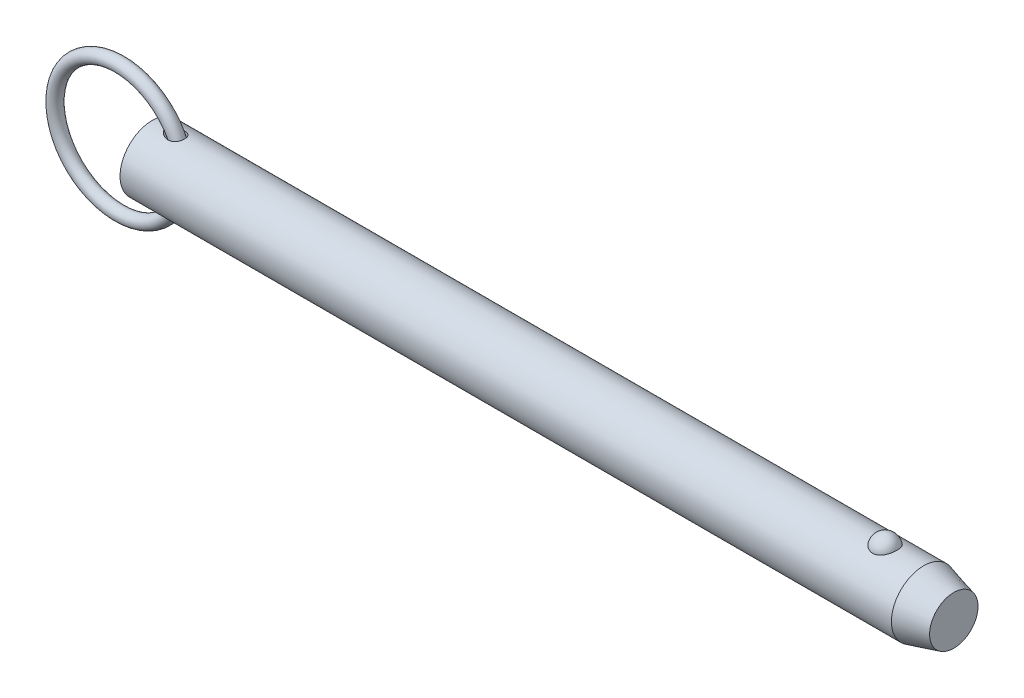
ISO-10303-21;
HEADER;
FILE_DESCRIPTION(('STEP AP214'),'2;1');
FILE_NAME('part.step','',(''),(''),'','','');
FILE_SCHEMA(('AUTOMOTIVE_DESIGN { 1 0 10303 214 1 1 1 1 }'));
ENDSEC;
DATA;
#1=APPLICATION_CONTEXT('core data for automotive mechanical design processes');
#2=APPLICATION_PROTOCOL_DEFINITION('international standard','automotive_design',2000,#1);
#3=PRODUCT_CONTEXT('',#1,'mechanical');
#4=PRODUCT('Part','Part','',(#3));
#5=PRODUCT_RELATED_PRODUCT_CATEGORY('part','',(#4));
#6=PRODUCT_DEFINITION_FORMATION('','',#4);
#7=PRODUCT_DEFINITION_CONTEXT('part definition',#1,'design');
#8=PRODUCT_DEFINITION('design','',#6,#7);
#9=PRODUCT_DEFINITION_SHAPE('','',#8);
#10=(LENGTH_UNIT() NAMED_UNIT(*) SI_UNIT(.MILLI.,.METRE.));
#11=(NAMED_UNIT(*) PLANE_ANGLE_UNIT() SI_UNIT($,.RADIAN.));
#12=(NAMED_UNIT(*) SI_UNIT($,.STERADIAN.) SOLID_ANGLE_UNIT());
#13=UNCERTAINTY_MEASURE_WITH_UNIT(LENGTH_MEASURE(1.E-05),#10,'distance_accuracy_value','');
#14=(GEOMETRIC_REPRESENTATION_CONTEXT(3) GLOBAL_UNCERTAINTY_ASSIGNED_CONTEXT((#13)) GLOBAL_UNIT_ASSIGNED_CONTEXT((#10,
#11,#12)) REPRESENTATION_CONTEXT('',''));
#15=CARTESIAN_POINT('',(0.,0.,0.));
#16=DIRECTION('',(0.,0.,1.));
#17=DIRECTION('',(1.,0.,0.));
#18=AXIS2_PLACEMENT_3D('',#15,#16,#17);
#19=CARTESIAN_POINT('',(-9.66825126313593,0.,0.));
#20=DIRECTION('',(0.,0.,1.));
#21=DIRECTION('',(1.,0.,0.));
#22=AXIS2_PLACEMENT_3D('',#19,#20,#21);
#23=TOROIDAL_SURFACE('',#22,19.05,1.905);
#24=CARTESIAN_POINT('',(11.2867487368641,0.,0.));
#25=VERTEX_POINT('',#24);
#26=VERTEX_LOOP('',#25);
#27=FACE_BOUND('',#26,.T.);
#28=ADVANCED_FACE('P0_F12',(#27),#23,.T.);
#29=CLOSED_SHELL('',(#28));
#30=MANIFOLD_SOLID_BREP('P0_B1',#29);
#31=CARTESIAN_POINT('',(0.,0.,0.));
#32=DIRECTION('',(1.,0.,0.));
#33=DIRECTION('',(0.,0.,-1.));
#34=AXIS2_PLACEMENT_3D('',#31,#32,#33);
#35=CYLINDRICAL_SURFACE('',#34,9.525);
#36=CARTESIAN_POINT('',(4.5669340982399,9.4314194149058,-1.33189820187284));
#37=CARTESIAN_POINT('',(4.70260475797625,9.41020313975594,-1.48215931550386));
#38=CARTESIAN_POINT('',(4.85555680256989,9.38755003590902,-1.61683982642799));
#39=CARTESIAN_POINT('',(5.10171959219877,9.35450554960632,-1.79512943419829));
#40=CARTESIAN_POINT('',(5.18674514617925,9.34362629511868,-1.85068909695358));
#41=CARTESIAN_POINT('',(5.3615438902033,9.32258514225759,-1.95392002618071));
#42=CARTESIAN_POINT('',(5.45131542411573,9.31242299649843,-2.00159402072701));
#43=CARTESIAN_POINT('',(5.70070211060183,9.28632120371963,-2.12033289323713));
#44=CARTESIAN_POINT('',(5.86420408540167,9.2714693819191,-2.18362944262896));
#45=CARTESIAN_POINT('',(6.19893345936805,9.24694163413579,-2.28525783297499));
#46=CARTESIAN_POINT('',(6.37015384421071,9.23726110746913,-2.32361187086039));
#47=CARTESIAN_POINT('',(6.73531776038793,9.22400982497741,-2.37575048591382));
#48=CARTESIAN_POINT('',(6.92975826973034,9.22118808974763,-2.38652934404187));
#49=CARTESIAN_POINT('',(7.21995443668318,9.22416297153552,-2.37494980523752));
#50=CARTESIAN_POINT('',(7.31643847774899,9.22635560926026,-2.366466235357));
#51=CARTESIAN_POINT('',(7.50796421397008,9.2331428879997,-2.33985028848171));
#52=CARTESIAN_POINT('',(7.6030065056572,9.23773650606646,-2.32172202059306));
#53=CARTESIAN_POINT('',(7.83273114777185,9.25183311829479,-2.26504721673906));
#54=CARTESIAN_POINT('',(7.96603028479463,9.26261470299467,-2.2209856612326));
#55=CARTESIAN_POINT('',(8.22310899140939,9.28816519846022,-2.11157306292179));
#56=CARTESIAN_POINT('',(8.34689477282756,9.30293147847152,-2.04623606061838));
#57=CARTESIAN_POINT('',(8.58136049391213,9.3349416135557,-1.89485344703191));
#58=CARTESIAN_POINT('',(8.69199721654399,9.35219324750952,-1.80874222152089));
#59=CARTESIAN_POINT('',(8.89592093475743,9.38707016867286,-1.6179918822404));
#60=CARTESIAN_POINT('',(8.98920771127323,9.40469546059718,-1.51335253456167));
#61=CARTESIAN_POINT('',(9.15057731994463,9.43713590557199,-1.29519427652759));
#62=CARTESIAN_POINT('',(9.21980158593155,9.45205440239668,-1.18253282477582));
#63=CARTESIAN_POINT('',(9.33826736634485,9.47856708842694,-0.946802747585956));
#64=CARTESIAN_POINT('',(9.38751161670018,9.49016173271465,-0.823735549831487));
#65=CARTESIAN_POINT('',(9.46423850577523,9.50859378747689,-0.572614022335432));
#66=CARTESIAN_POINT('',(9.4920239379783,9.5154972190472,-0.444656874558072));
#67=CARTESIAN_POINT('',(9.52636926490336,9.5240690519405,-0.18575268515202));
#68=CARTESIAN_POINT('',(9.53292923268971,9.52573747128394,-0.0548056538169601));
#69=CARTESIAN_POINT('',(9.52467276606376,9.52365852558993,0.206503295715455));
#70=CARTESIAN_POINT('',(9.50983454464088,9.51990564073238,0.33686448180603));
#71=CARTESIAN_POINT('',(9.45907362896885,9.50737852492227,0.593166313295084));
#72=CARTESIAN_POINT('',(9.42315106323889,9.49860432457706,0.719106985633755));
#73=CARTESIAN_POINT('',(9.33106648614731,9.4769892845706,0.962959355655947));
#74=CARTESIAN_POINT('',(9.27490839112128,9.46414923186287,1.08087260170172));
#75=CARTESIAN_POINT('',(9.14375803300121,9.43581000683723,1.30534632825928));
#76=CARTESIAN_POINT('',(9.06876720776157,9.42031103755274,1.41190767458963));
#77=CARTESIAN_POINT('',(8.90203187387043,9.38836719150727,1.61069439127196));
#78=CARTESIAN_POINT('',(8.81029913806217,9.37192298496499,1.70292975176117));
#79=CARTESIAN_POINT('',(8.6126877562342,9.33985045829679,1.87086859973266));
#80=CARTESIAN_POINT('',(8.50680947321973,9.3242221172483,1.94657251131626));
#81=CARTESIAN_POINT('',(8.28220546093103,9.29513431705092,2.08109032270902));
#82=CARTESIAN_POINT('',(8.16329919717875,9.28171415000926,2.13961034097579));
#83=CARTESIAN_POINT('',(7.91756052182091,9.25859072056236,2.23755716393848));
#84=CARTESIAN_POINT('',(7.79072606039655,9.24888842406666,2.27697900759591));
#85=CARTESIAN_POINT('',(7.52377913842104,9.23338749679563,2.33907806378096));
#86=CARTESIAN_POINT('',(7.3833476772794,9.22789571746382,2.36044900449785));
#87=CARTESIAN_POINT('',(7.10081394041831,9.22210229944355,2.3829751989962));
#88=CARTESIAN_POINT('',(6.95871103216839,9.22180269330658,2.38412253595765));
#89=CARTESIAN_POINT('',(6.65642691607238,9.22632724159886,2.36656230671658));
#90=CARTESIAN_POINT('',(6.49641694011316,9.23185415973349,2.3451317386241));
#91=CARTESIAN_POINT('',(6.18115433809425,9.24811737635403,2.28014143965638));
#92=CARTESIAN_POINT('',(6.02590710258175,9.25885936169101,2.23655754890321));
#93=CARTESIAN_POINT('',(5.69904720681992,9.28624254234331,2.12025087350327));
#94=CARTESIAN_POINT('',(5.52873601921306,9.30354853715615,2.04400672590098));
#95=CARTESIAN_POINT('',(5.20289495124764,9.34106989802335,1.86504730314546));
#96=CARTESIAN_POINT('',(5.04735968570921,9.36128419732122,1.76234172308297));
#97=CARTESIAN_POINT('',(4.7928712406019,9.39697639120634,1.55895334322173));
#98=CARTESIAN_POINT('',(4.68938704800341,9.41240250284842,1.46392900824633));
#99=CARTESIAN_POINT('',(4.4984714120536,9.44202586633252,1.25875918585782));
#100=CARTESIAN_POINT('',(4.41101129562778,9.45622528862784,1.14864133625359));
#101=CARTESIAN_POINT('',(4.27502257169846,9.47888210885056,0.940600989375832));
#102=CARTESIAN_POINT('',(4.22216329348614,9.48791121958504,0.845586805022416));
#103=CARTESIAN_POINT('',(4.1324147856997,9.50344321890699,0.648051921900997));
#104=CARTESIAN_POINT('',(4.0955118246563,9.50994827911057,0.545537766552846));
#105=CARTESIAN_POINT('',(4.04043124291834,9.51971586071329,0.334452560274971));
#106=CARTESIAN_POINT('',(4.02240728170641,9.52295176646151,0.225839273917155));
#107=CARTESIAN_POINT('',(4.00750873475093,9.52562364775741,0.00713006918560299));
#108=CARTESIAN_POINT('',(4.01062334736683,9.52506156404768,-0.102965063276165));
#109=CARTESIAN_POINT('',(4.03592967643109,9.52053221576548,-0.306944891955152));
#110=CARTESIAN_POINT('',(4.05571676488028,9.51699426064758,-0.40115176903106));
#111=CARTESIAN_POINT('',(4.10967975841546,9.5074546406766,-0.585176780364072));
#112=CARTESIAN_POINT('',(4.1438599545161,9.50145224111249,-0.674993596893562));
#113=CARTESIAN_POINT('',(4.23261356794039,9.48611703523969,-0.866116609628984));
#114=CARTESIAN_POINT('',(4.28990016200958,9.47635800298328,-0.966121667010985));
#115=CARTESIAN_POINT('',(4.41856577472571,9.45502867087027,-1.15640011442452));
#116=CARTESIAN_POINT('',(4.4899691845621,9.44345524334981,-1.24665623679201));
#117=CARTESIAN_POINT('',(4.5669340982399,9.4314194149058,-1.33189820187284));
#118=B_SPLINE_CURVE_WITH_KNOTS('',3,(#36,#37,#38,#39,#40,#41,#42,#43,#44,#45,#46,#47,#48,#49,
#50,#51,#52,#53,#54,#55,#56,#57,#58,#59,#60,#61,#62,#63,#64,#65,#66,#67,#68,#69,#70,#71,#72,#73,
#74,#75,#76,#77,#78,#79,#80,#81,#82,#83,#84,#85,#86,#87,#88,#89,#90,#91,#92,#93,#94,#95,#96,#97,
#98,#99,#100,#101,#102,#103,#104,#105,#106,#107,#108,#109,#110,#111,#112,#113,#114,#115,#116,
#117),.UNSPECIFIED.,.T.,.F.,(4,2,2,2,2,2,2,2,2,2,2,2,2,2,2,2,2,2,2,2,2,2,2,2,2,2,2,2,2,2,2,2,2,
2,2,2,2,2,2,2,4),(0.,0.609951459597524,0.916123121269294,1.22218863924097,1.74791337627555,
2.27316961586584,2.85362722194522,3.14383229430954,3.43391382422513,3.85437497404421,
4.27455920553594,4.69608835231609,5.11762282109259,5.5149005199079,5.91212379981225,
6.30363414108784,6.69514313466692,7.08705103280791,7.47895654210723,7.87078624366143,
8.26258603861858,8.65411137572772,9.04562666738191,9.44349251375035,9.84146165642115,
10.2662286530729,10.6911619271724,11.1739180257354,11.6572017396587,12.2170157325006,
12.7766249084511,13.1992556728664,13.6211226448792,13.9471990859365,14.2729943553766,
14.6014211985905,14.9296802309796,15.2173810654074,15.505167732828,15.8505863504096,
16.1966070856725),.UNSPECIFIED.);
#119=CARTESIAN_POINT('',(4.5669340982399,9.4314194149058,-1.33189820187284));
#120=VERTEX_POINT('',#119);
#121=EDGE_CURVE('P1_E40',#120,#120,#118,.T.);
#122=ORIENTED_EDGE('',*,*,#121,.T.);
#123=EDGE_LOOP('',(#122));
#124=FACE_BOUND('',#123,.T.);
#125=CARTESIAN_POINT('',(227.643054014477,0.,0.));
#126=DIRECTION('',(1.,0.,0.));
#127=DIRECTION('',(0.,0.,-1.));
#128=AXIS2_PLACEMENT_3D('',#125,#126,#127);
#129=CIRCLE('',#128,9.525);
#130=CARTESIAN_POINT('',(227.643054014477,0.,-9.525));
#131=VERTEX_POINT('',#130);
#132=EDGE_CURVE('P1_E25',#131,#131,#129,.T.);
#133=ORIENTED_EDGE('',*,*,#132,.F.);
#134=EDGE_LOOP('',(#133));
#135=FACE_BOUND('',#134,.T.);
#136=CARTESIAN_POINT('',(0.,0.,0.));
#137=DIRECTION('',(1.,0.,0.));
#138=DIRECTION('',(0.,0.,-1.));
#139=AXIS2_PLACEMENT_3D('',#136,#137,#138);
#140=CIRCLE('',#139,9.525);
#141=CARTESIAN_POINT('',(0.,0.,-9.525));
#142=VERTEX_POINT('',#141);
#143=EDGE_CURVE('P1_E9',#142,#142,#140,.T.);
#144=ORIENTED_EDGE('',*,*,#143,.T.);
#145=EDGE_LOOP('',(#144));
#146=FACE_BOUND('',#145,.T.);
#147=CARTESIAN_POINT('',(216.245757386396,8.80405803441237,3.63513233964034));
#148=CARTESIAN_POINT('',(216.151676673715,8.80405953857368,3.63513053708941));
#149=CARTESIAN_POINT('',(216.057561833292,8.80561325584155,3.63137461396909));
#150=CARTESIAN_POINT('',(215.870012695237,8.81177748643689,3.61638665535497));
#151=CARTESIAN_POINT('',(215.776578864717,8.81638992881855,3.60514990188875));
#152=CARTESIAN_POINT('',(215.497945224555,8.83467114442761,3.56024627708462));
#153=CARTESIAN_POINT('',(215.314691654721,8.85278327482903,3.5153862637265));
#154=CARTESIAN_POINT('',(214.959509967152,8.89871214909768,3.39742145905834));
#155=CARTESIAN_POINT('',(214.787553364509,8.92650327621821,3.32439116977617));
#156=CARTESIAN_POINT('',(214.458707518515,8.9887481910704,3.15220244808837));
#157=CARTESIAN_POINT('',(214.301811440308,9.02319893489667,3.05305594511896));
#158=CARTESIAN_POINT('',(214.002214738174,9.09629186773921,2.82797815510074));
#159=CARTESIAN_POINT('',(213.860060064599,9.13502685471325,2.70135138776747));
#160=CARTESIAN_POINT('',(213.598299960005,9.21186572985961,2.42641932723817));
#161=CARTESIAN_POINT('',(213.478701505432,9.24996941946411,2.2781073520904));
#162=CARTESIAN_POINT('',(213.259645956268,9.32341082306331,1.95652290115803));
#163=CARTESIAN_POINT('',(213.161317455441,9.35855090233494,1.78243511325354));
#164=CARTESIAN_POINT('',(212.993819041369,9.42045142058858,1.41937246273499));
#165=CARTESIAN_POINT('',(212.924651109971,9.44721128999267,1.23039658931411));
#166=CARTESIAN_POINT('',(212.816199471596,9.48990641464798,0.840370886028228));
#167=CARTESIAN_POINT('',(212.777288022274,9.50570658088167,0.639202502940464));
#168=CARTESIAN_POINT('',(212.731555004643,9.52433146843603,0.232664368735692));
#169=CARTESIAN_POINT('',(212.724732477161,9.52715657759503,0.0272947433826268));
#170=CARTESIAN_POINT('',(212.743255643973,9.51956918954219,-0.380478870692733));
#171=CARTESIAN_POINT('',(212.768405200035,9.50923740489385,-0.582893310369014));
#172=CARTESIAN_POINT('',(212.85002537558,9.47651897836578,-0.98029399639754));
#173=CARTESIAN_POINT('',(212.906496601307,9.45413210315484,-1.17528009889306));
#174=CARTESIAN_POINT('',(213.049719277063,9.39954044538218,-1.55263697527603));
#175=CARTESIAN_POINT('',(213.136512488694,9.36732213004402,-1.73498993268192));
#176=CARTESIAN_POINT('',(213.338610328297,9.29640700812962,-2.08177763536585));
#177=CARTESIAN_POINT('',(213.453917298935,9.25770966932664,-2.24621090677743));
#178=CARTESIAN_POINT('',(213.711264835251,9.17775604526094,-2.5533833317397));
#179=CARTESIAN_POINT('',(213.853434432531,9.136488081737,-2.696011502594));
#180=CARTESIAN_POINT('',(214.16089985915,9.05620497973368,-2.95451229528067));
#181=CARTESIAN_POINT('',(214.326193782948,9.01718965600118,-3.07038711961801));
#182=CARTESIAN_POINT('',(214.672052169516,8.94680019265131,-3.26976836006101));
#183=CARTESIAN_POINT('',(214.852227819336,8.91528408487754,-3.35389750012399));
#184=CARTESIAN_POINT('',(215.225651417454,8.86272514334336,-3.49043503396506));
#185=CARTESIAN_POINT('',(215.418894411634,8.84167836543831,-3.54285537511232));
#186=CARTESIAN_POINT('',(215.802503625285,8.81348056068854,-3.61241306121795));
#187=CARTESIAN_POINT('',(215.992525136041,8.80568348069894,-3.6311933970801));
#188=CARTESIAN_POINT('',(216.373190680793,8.80289410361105,-3.63795342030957));
#189=CARTESIAN_POINT('',(216.563834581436,8.80789922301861,-3.62593932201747));
#190=CARTESIAN_POINT('',(216.934007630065,8.82974915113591,-3.57238430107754));
#191=CARTESIAN_POINT('',(217.113697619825,8.84621463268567,-3.53178890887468));
#192=CARTESIAN_POINT('',(217.463422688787,8.88875330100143,-3.42331083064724));
#193=CARTESIAN_POINT('',(217.633456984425,8.91482726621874,-3.35542593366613));
#194=CARTESIAN_POINT('',(217.963237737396,8.97448239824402,-3.19248225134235));
#195=CARTESIAN_POINT('',(218.122680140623,9.00821446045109,-3.0968647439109));
#196=CARTESIAN_POINT('',(218.423513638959,9.07935398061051,-2.88162736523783));
#197=CARTESIAN_POINT('',(218.564900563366,9.11676228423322,-2.76200196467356));
#198=CARTESIAN_POINT('',(218.83331931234,9.19347419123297,-2.49516285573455));
#199=CARTESIAN_POINT('',(218.959275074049,9.23277872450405,-2.34686614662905));
#200=CARTESIAN_POINT('',(219.185522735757,9.30737610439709,-2.03093683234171));
#201=CARTESIAN_POINT('',(219.28581004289,9.34266823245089,-1.86330077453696));
#202=CARTESIAN_POINT('',(219.461514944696,9.40674710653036,-1.50744893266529));
#203=CARTESIAN_POINT('',(219.536041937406,9.43529176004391,-1.31874876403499));
#204=CARTESIAN_POINT('',(219.65416505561,9.48144132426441,-0.930631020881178));
#205=CARTESIAN_POINT('',(219.697760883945,9.49904612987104,-0.731213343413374));
#206=CARTESIAN_POINT('',(219.753158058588,9.5215314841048,-0.327147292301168));
#207=CARTESIAN_POINT('',(219.764935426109,9.52640243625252,-0.122495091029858));
#208=CARTESIAN_POINT('',(219.756382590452,9.5228957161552,0.286018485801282));
#209=CARTESIAN_POINT('',(219.73605305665,9.5145183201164,0.489879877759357));
#210=CARTESIAN_POINT('',(219.663884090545,9.48544083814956,0.889994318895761));
#211=CARTESIAN_POINT('',(219.612199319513,9.46480124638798,1.08627971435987));
#212=CARTESIAN_POINT('',(219.478491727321,9.4133389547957,1.46682086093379));
#213=CARTESIAN_POINT('',(219.396466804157,9.38251554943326,1.65107577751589));
#214=CARTESIAN_POINT('',(219.20319292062,9.31365636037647,2.00346348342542));
#215=CARTESIAN_POINT('',(219.091783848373,9.27558138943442,2.17150083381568));
#216=CARTESIAN_POINT('',(218.842294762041,9.19638714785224,2.48563115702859));
#217=CARTESIAN_POINT('',(218.704216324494,9.15526805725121,2.63172542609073));
#218=CARTESIAN_POINT('',(218.404843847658,9.07465393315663,2.89750997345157));
#219=CARTESIAN_POINT('',(218.243610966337,9.03515496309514,3.01726776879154));
#220=CARTESIAN_POINT('',(217.901613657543,8.96227564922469,3.22732920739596));
#221=CARTESIAN_POINT('',(217.720841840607,8.92889763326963,3.31762165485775));
#222=CARTESIAN_POINT('',(217.351445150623,8.8734538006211,3.46314419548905));
#223=CARTESIAN_POINT('',(217.16332371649,8.85102983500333,3.51950082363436));
#224=CARTESIAN_POINT('',(216.87578699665,8.82666967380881,3.57993683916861));
#225=CARTESIAN_POINT('',(216.779133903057,8.82009725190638,3.59606217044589));
#226=CARTESIAN_POINT('',(216.584677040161,8.81020897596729,3.62022512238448));
#227=CARTESIAN_POINT('',(216.48687410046,8.80689090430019,3.62826825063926));
#228=CARTESIAN_POINT('',(216.341224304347,8.80445615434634,3.63416760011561));
#229=CARTESIAN_POINT('',(216.293495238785,8.80405727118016,3.63513325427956));
#230=CARTESIAN_POINT('',(216.245757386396,8.80405803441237,3.63513233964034));
#231=B_SPLINE_CURVE_WITH_KNOTS('',3,(#147,#148,#149,#150,#151,#152,#153,#154,#155,#156,#157,
#158,#159,#160,#161,#162,#163,#164,#165,#166,#167,#168,#169,#170,#171,#172,#173,#174,#175,#176,
#177,#178,#179,#180,#181,#182,#183,#184,#185,#186,#187,#188,#189,#190,#191,#192,#193,#194,#195,
#196,#197,#198,#199,#200,#201,#202,#203,#204,#205,#206,#207,#208,#209,#210,#211,#212,#213,#214,
#215,#216,#217,#218,#219,#220,#221,#222,#223,#224,#225,#226,#227,#228,#229,#230),.UNSPECIFIED.,
.T.,.F.,(4,2,2,2,2,2,2,2,2,2,2,2,2,2,2,2,2,2,2,2,2,2,2,2,2,2,2,2,2,2,2,2,2,2,2,2,2,2,2,2,2,4),
(0.,0.282202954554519,0.564584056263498,1.13017050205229,1.69427128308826,2.25811483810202,
2.83836627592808,3.41879688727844,4.02497117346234,4.63118665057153,5.24474754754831,
5.85829010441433,6.46808687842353,7.07789545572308,7.6885472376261,8.299249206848,
8.91296283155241,9.52662591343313,10.1275338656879,10.7282152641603,11.2986646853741,
11.8689989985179,12.4213015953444,12.973648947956,13.5380053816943,14.1024919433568,
14.695298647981,15.2882113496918,15.8999469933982,16.5116885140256,17.1238909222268,
17.7360805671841,18.3452748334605,18.9545113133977,19.567138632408,20.179729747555,
20.7907316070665,21.4019653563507,21.9915938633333,22.2859053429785,22.5800161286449,
22.7232098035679),.UNSPECIFIED.);
#232=CARTESIAN_POINT('',(216.245757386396,8.80405803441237,3.63513233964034));
#233=VERTEX_POINT('',#232);
#234=EDGE_CURVE('P1_E34',#233,#233,#231,.T.);
#235=ORIENTED_EDGE('',*,*,#234,.T.);
#236=EDGE_LOOP('',(#235));
#237=FACE_BOUND('',#236,.T.);
#238=CARTESIAN_POINT('',(4.5669340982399,-9.4314194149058,-1.33189820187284));
#239=CARTESIAN_POINT('',(4.48932984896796,-9.4435553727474,-1.24594548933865));
#240=CARTESIAN_POINT('',(4.41737309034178,-9.45522193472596,-1.1548795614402));
#241=CARTESIAN_POINT('',(4.28781047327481,-9.47670896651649,-0.962782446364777));
#242=CARTESIAN_POINT('',(4.23019403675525,-9.48653079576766,-0.861758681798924));
#243=CARTESIAN_POINT('',(4.132545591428,-9.5034118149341,-0.649723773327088));
#244=CARTESIAN_POINT('',(4.09271158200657,-9.51043980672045,-0.538615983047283));
#245=CARTESIAN_POINT('',(4.04973167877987,-9.51806966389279,-0.367764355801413));
#246=CARTESIAN_POINT('',(4.03820037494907,-9.52012756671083,-0.310118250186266));
#247=CARTESIAN_POINT('',(4.02100287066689,-9.52320274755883,-0.193935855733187));
#248=CARTESIAN_POINT('',(4.01533565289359,-9.52422020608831,-0.135399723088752));
#249=CARTESIAN_POINT('',(4.0081707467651,-9.52550497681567,0.0247266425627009));
#250=CARTESIAN_POINT('',(4.0127049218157,-9.52468821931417,0.126661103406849));
#251=CARTESIAN_POINT('',(4.03954973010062,-9.51988506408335,0.328012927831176));
#252=CARTESIAN_POINT('',(4.06186450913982,-9.51589792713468,0.427429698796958));
#253=CARTESIAN_POINT('',(4.12088980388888,-9.50548528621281,0.616362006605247));
#254=CARTESIAN_POINT('',(4.15684838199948,-9.49918763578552,0.706123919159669));
#255=CARTESIAN_POINT('',(4.24094647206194,-9.48470618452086,0.87952277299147));
#256=CARTESIAN_POINT('',(4.28909090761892,-9.47652162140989,0.963157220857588));
#257=CARTESIAN_POINT('',(4.42295891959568,-9.45426317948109,1.16513741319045));
#258=CARTESIAN_POINT('',(4.51523752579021,-9.43933320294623,1.27905352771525));
#259=CARTESIAN_POINT('',(4.71682295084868,-9.40825940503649,1.49055892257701));
#260=CARTESIAN_POINT('',(4.82617286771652,-9.39211256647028,1.58810554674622));
#261=CARTESIAN_POINT('',(5.09064226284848,-9.35555264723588,1.79246125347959));
#262=CARTESIAN_POINT('',(5.2499041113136,-9.33524115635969,1.89393122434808));
#263=CARTESIAN_POINT('',(5.58309255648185,-9.29785396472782,2.06968659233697));
#264=CARTESIAN_POINT('',(5.75702897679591,-9.28078045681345,2.14395359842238));
#265=CARTESIAN_POINT('',(6.11646882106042,-9.25213303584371,2.26440412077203));
#266=CARTESIAN_POINT('',(6.30205582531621,-9.2406056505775,2.31035092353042));
#267=CARTESIAN_POINT('',(6.67856093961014,-9.22541807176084,2.37029728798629));
#268=CARTESIAN_POINT('',(6.8694704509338,-9.22174585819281,2.3843456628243));
#269=CARTESIAN_POINT('',(7.21217144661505,-9.22344239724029,2.37775005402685));
#270=CARTESIAN_POINT('',(7.36409439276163,-9.22713860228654,2.36352577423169));
#271=CARTESIAN_POINT('',(7.66346227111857,-9.24048072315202,2.31082299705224));
#272=CARTESIAN_POINT('',(7.81090958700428,-9.25012341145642,2.27235765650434));
#273=CARTESIAN_POINT('',(8.09730316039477,-9.2746609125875,2.17003648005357));
#274=CARTESIAN_POINT('',(8.23619652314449,-9.28958517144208,2.10603803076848));
#275=CARTESIAN_POINT('',(8.49918675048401,-9.32290326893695,1.95324442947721));
#276=CARTESIAN_POINT('',(8.62328895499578,-9.34129584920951,1.86445826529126));
#277=CARTESIAN_POINT('',(8.84006515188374,-9.37706953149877,1.67466761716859));
#278=CARTESIAN_POINT('',(8.93465172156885,-9.39436331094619,1.57582357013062));
#279=CARTESIAN_POINT('',(9.1049023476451,-9.42761680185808,1.36280955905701));
#280=CARTESIAN_POINT('',(9.18057146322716,-9.44357686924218,1.24864370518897));
#281=CARTESIAN_POINT('',(9.30789178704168,-9.47159985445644,1.01379272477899));
#282=CARTESIAN_POINT('',(9.36045544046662,-9.48380365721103,0.893617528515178));
#283=CARTESIAN_POINT('',(9.44498362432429,-9.50388751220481,0.645890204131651));
#284=CARTESIAN_POINT('',(9.47694947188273,-9.51176784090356,0.518338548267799));
#285=CARTESIAN_POINT('',(9.51944262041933,-9.52232073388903,0.260103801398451));
#286=CARTESIAN_POINT('',(9.53006646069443,-9.52501674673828,0.129437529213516));
#287=CARTESIAN_POINT('',(9.52993291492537,-9.52498309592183,-0.131885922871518));
#288=CARTESIAN_POINT('',(9.51917525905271,-9.52225336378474,-0.262543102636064));
#289=CARTESIAN_POINT('',(9.47648788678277,-9.51165418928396,-0.520312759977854));
#290=CARTESIAN_POINT('',(9.44453086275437,-9.50377811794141,-0.647420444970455));
#291=CARTESIAN_POINT('',(9.36015568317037,-9.48373425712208,-0.894290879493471));
#292=CARTESIAN_POINT('',(9.30773827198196,-9.47156662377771,-1.0140538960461));
#293=CARTESIAN_POINT('',(9.1838089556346,-9.44428888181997,-1.24269386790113));
#294=CARTESIAN_POINT('',(9.11232064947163,-9.42918241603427,-1.35158405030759));
#295=CARTESIAN_POINT('',(8.9521268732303,-9.39767706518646,-1.55562459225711));
#296=CARTESIAN_POINT('',(8.86342281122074,-9.3812782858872,-1.65077607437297));
#297=CARTESIAN_POINT('',(8.67104443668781,-9.34891827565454,-1.8251751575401));
#298=CARTESIAN_POINT('',(8.56732858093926,-9.33295841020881,-1.90437711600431));
#299=CARTESIAN_POINT('',(8.3481843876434,-9.30317889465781,-2.0449122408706));
#300=CARTESIAN_POINT('',(8.23275529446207,-9.28935938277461,-2.10624425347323));
#301=CARTESIAN_POINT('',(7.9896124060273,-9.26475003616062,-2.2120340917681));
#302=CARTESIAN_POINT('',(7.86162088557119,-9.25407358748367,-2.25587700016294));
#303=CARTESIAN_POINT('',(7.60027499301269,-9.23720810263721,-2.32397032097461));
#304=CARTESIAN_POINT('',(7.46691858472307,-9.23102078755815,-2.34821321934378));
#305=CARTESIAN_POINT('',(7.18516230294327,-9.22302718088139,-2.37943079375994));
#306=CARTESIAN_POINT('',(7.03654454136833,-9.22169704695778,-2.38452997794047));
#307=CARTESIAN_POINT('',(6.74015049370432,-9.22442327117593,-2.37395141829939));
#308=CARTESIAN_POINT('',(6.5923745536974,-9.22848170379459,-2.35826567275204));
#309=CARTESIAN_POINT('',(6.27762777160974,-9.2422287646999,-2.30385559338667));
#310=CARTESIAN_POINT('',(6.11124715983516,-9.25269504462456,-2.26192683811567));
#311=CARTESIAN_POINT('',(5.78635920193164,-9.27830776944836,-2.15445569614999));
#312=CARTESIAN_POINT('',(5.62786567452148,-9.29346211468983,-2.08887341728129));
#313=CARTESIAN_POINT('',(5.39013065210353,-9.31931237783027,-1.96924953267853));
#314=CARTESIAN_POINT('',(5.30683088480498,-9.32901725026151,-1.92292485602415));
#315=CARTESIAN_POINT('',(5.14455801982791,-9.34899035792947,-1.82334419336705));
#316=CARTESIAN_POINT('',(5.06558607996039,-9.35925874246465,-1.77008636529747));
#317=CARTESIAN_POINT('',(4.83670950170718,-9.39034445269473,-1.60010986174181));
#318=CARTESIAN_POINT('',(4.69422471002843,-9.41151337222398,-1.47288240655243));
#319=CARTESIAN_POINT('',(4.5669340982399,-9.4314194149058,-1.33189820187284));
#320=B_SPLINE_CURVE_WITH_KNOTS('',3,(#238,#239,#240,#241,#242,#243,#244,#245,#246,#247,#248,
#249,#250,#251,#252,#253,#254,#255,#256,#257,#258,#259,#260,#261,#262,#263,#264,#265,#266,#267,
#268,#269,#270,#271,#272,#273,#274,#275,#276,#277,#278,#279,#280,#281,#282,#283,#284,#285,#286,
#287,#288,#289,#290,#291,#292,#293,#294,#295,#296,#297,#298,#299,#300,#301,#302,#303,#304,#305,
#306,#307,#308,#309,#310,#311,#312,#313,#314,#315,#316,#317,#318,#319),.UNSPECIFIED.,.T.,.F.,(4,
2,2,2,2,2,2,2,2,2,2,2,2,2,2,2,2,2,2,2,2,2,2,2,2,2,2,2,2,2,2,2,2,2,2,2,2,2,2,2,4),(0.,
0.348900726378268,0.697543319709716,1.0499765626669,1.22617690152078,1.40234666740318,
1.70666745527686,2.01105922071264,2.30066493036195,2.59038784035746,3.03001384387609,
3.47076822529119,4.03766594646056,4.60494622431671,5.17690598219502,5.74798989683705,
6.20400848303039,6.65977977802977,7.11813321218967,7.57632066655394,7.98791759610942,
8.39940433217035,8.79273459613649,9.18603970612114,9.57756168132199,9.96908859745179,
10.3611208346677,10.7531388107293,11.1446739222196,11.536177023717,11.9287850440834,
12.3214184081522,12.7268448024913,13.1324265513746,13.5768390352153,14.0214226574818,
14.5351685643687,15.0497849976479,15.3368801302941,15.6240516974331,16.1963372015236),.UNSPECIFIED.);
#321=CARTESIAN_POINT('',(4.5669340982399,-9.4314194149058,-1.33189820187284));
#322=VERTEX_POINT('',#321);
#323=EDGE_CURVE('P1_E17',#322,#322,#320,.T.);
#324=ORIENTED_EDGE('',*,*,#323,.T.);
#325=EDGE_LOOP('',(#324));
#326=FACE_BOUND('',#325,.T.);
#327=ADVANCED_FACE('P1_F13',(#124,#135,#146,#237,#326),#35,.T.);
#328=CARTESIAN_POINT('',(0.,0.,0.));
#329=DIRECTION('',(-1.,0.,0.));
#330=DIRECTION('',(0.,0.,1.));
#331=AXIS2_PLACEMENT_3D('',#328,#329,#330);
#332=PLANE('',#331);
#333=ORIENTED_EDGE('',*,*,#143,.F.);
#334=EDGE_LOOP('',(#333));
#335=FACE_BOUND('',#334,.T.);
#336=ADVANCED_FACE('P1_F15',(#335),#332,.T.);
#337=CARTESIAN_POINT('',(236.53,0.,0.));
#338=DIRECTION('',(-1.,0.,0.));
#339=DIRECTION('',(0.,0.,1.));
#340=AXIS2_PLACEMENT_3D('',#337,#338,#339);
#341=CONICAL_SURFACE('',#340,7.14375000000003,0.261799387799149);
#342=ORIENTED_EDGE('',*,*,#132,.T.);
#343=EDGE_LOOP('',(#342));
#344=FACE_BOUND('',#343,.T.);
#345=CARTESIAN_POINT('',(236.53,0.,0.));
#346=DIRECTION('',(1.,0.,0.));
#347=DIRECTION('',(0.,0.,-1.));
#348=AXIS2_PLACEMENT_3D('',#345,#346,#347);
#349=CIRCLE('',#348,7.14375000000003);
#350=CARTESIAN_POINT('',(236.53,0.,-7.14375000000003));
#351=VERTEX_POINT('',#350);
#352=EDGE_CURVE('P1_E30',#351,#351,#349,.T.);
#353=ORIENTED_EDGE('',*,*,#352,.F.);
#354=EDGE_LOOP('',(#353));
#355=FACE_BOUND('',#354,.T.);
#356=ADVANCED_FACE('P1_F55',(#344,#355),#341,.T.);
#357=CARTESIAN_POINT('',(236.53,7.14375000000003,0.));
#358=DIRECTION('',(1.,0.,0.));
#359=DIRECTION('',(0.,0.,-1.));
#360=AXIS2_PLACEMENT_3D('',#357,#358,#359);
#361=PLANE('',#360);
#362=ORIENTED_EDGE('',*,*,#352,.T.);
#363=EDGE_LOOP('',(#362));
#364=FACE_BOUND('',#363,.T.);
#365=ADVANCED_FACE('P1_F51',(#364),#361,.T.);
#366=CARTESIAN_POINT('',(216.245757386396,8.5725,0.));
#367=DIRECTION('',(-1.,0.,0.));
#368=DIRECTION('',(0.,1.,0.));
#369=AXIS2_PLACEMENT_3D('',#366,#367,#368);
#370=SPHERICAL_SURFACE('',#369,3.64249999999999);
#371=ORIENTED_EDGE('',*,*,#234,.F.);
#372=EDGE_LOOP('',(#371));
#373=FACE_BOUND('',#372,.T.);
#374=ADVANCED_FACE('P1_F46',(#373),#370,.T.);
#375=CARTESIAN_POINT('',(-9.66825126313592,0.,0.));
#376=DIRECTION('',(0.,0.,1.));
#377=DIRECTION('',(1.,0.,0.));
#378=AXIS2_PLACEMENT_3D('',#375,#376,#377);
#379=TOROIDAL_SURFACE('',#378,19.05,2.38125);
#380=ORIENTED_EDGE('',*,*,#323,.F.);
#381=EDGE_LOOP('',(#380));
#382=FACE_BOUND('',#381,.T.);
#383=ORIENTED_EDGE('',*,*,#121,.F.);
#384=EDGE_LOOP('',(#383));
#385=FACE_BOUND('',#384,.T.);
#386=ADVANCED_FACE('P1_F50',(#382,#385),#379,.F.);
#387=CLOSED_SHELL('',(#327,#336,#356,#365,#374,#386));
#388=MANIFOLD_SOLID_BREP('P1_B1',#387);
#389=ADVANCED_BREP_SHAPE_REPRESENTATION('',(#18,#30,#388),#14);
#390=SHAPE_DEFINITION_REPRESENTATION(#9,#389);
ENDSEC;
END-ISO-10303-21;
